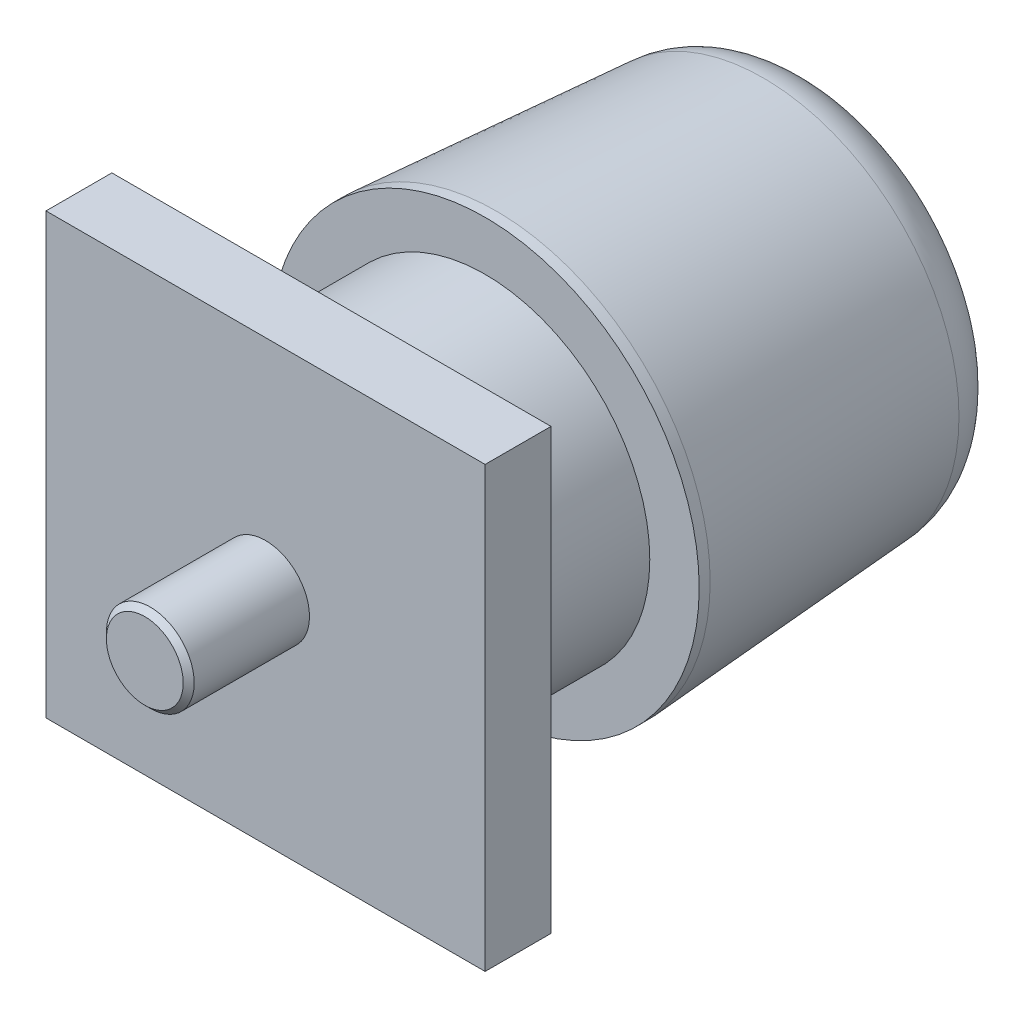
ISO-10303-21;
HEADER;
FILE_DESCRIPTION(('STEP AP214'),'2;1');
FILE_NAME('part.step','',(''),(''),'','','');
FILE_SCHEMA(('AUTOMOTIVE_DESIGN { 1 0 10303 214 1 1 1 1 }'));
ENDSEC;
DATA;
#1=APPLICATION_CONTEXT('core data for automotive mechanical design processes');
#2=APPLICATION_PROTOCOL_DEFINITION('international standard','automotive_design',2000,#1);
#3=PRODUCT_CONTEXT('',#1,'mechanical');
#4=PRODUCT('Part','Part','',(#3));
#5=PRODUCT_RELATED_PRODUCT_CATEGORY('part','',(#4));
#6=PRODUCT_DEFINITION_FORMATION('','',#4);
#7=PRODUCT_DEFINITION_CONTEXT('part definition',#1,'design');
#8=PRODUCT_DEFINITION('design','',#6,#7);
#9=PRODUCT_DEFINITION_SHAPE('','',#8);
#10=(LENGTH_UNIT() NAMED_UNIT(*) SI_UNIT(.MILLI.,.METRE.));
#11=(NAMED_UNIT(*) PLANE_ANGLE_UNIT() SI_UNIT($,.RADIAN.));
#12=(NAMED_UNIT(*) SI_UNIT($,.STERADIAN.) SOLID_ANGLE_UNIT());
#13=UNCERTAINTY_MEASURE_WITH_UNIT(LENGTH_MEASURE(1.E-05),#10,'distance_accuracy_value','');
#14=(GEOMETRIC_REPRESENTATION_CONTEXT(3) GLOBAL_UNCERTAINTY_ASSIGNED_CONTEXT((#13)) GLOBAL_UNIT_ASSIGNED_CONTEXT((#10,
#11,#12)) REPRESENTATION_CONTEXT('',''));
#15=CARTESIAN_POINT('',(0.,0.,0.));
#16=DIRECTION('',(0.,0.,1.));
#17=DIRECTION('',(1.,0.,0.));
#18=AXIS2_PLACEMENT_3D('',#15,#16,#17);
#19=CARTESIAN_POINT('',(-20.,-20.,50.));
#20=DIRECTION('',(0.,0.,1.));
#21=DIRECTION('',(1.,0.,0.));
#22=AXIS2_PLACEMENT_3D('',#19,#20,#21);
#23=PLANE('',#22);
#24=DIRECTION('',(0.,1.,0.));
#25=VECTOR('',#24,1.);
#26=CARTESIAN_POINT('',(-20.,0.,50.));
#27=LINE('',#26,#25);
#28=CARTESIAN_POINT('',(-20.,-20.,50.));
#29=VERTEX_POINT('',#28);
#30=CARTESIAN_POINT('',(-20.,20.,50.));
#31=VERTEX_POINT('',#30);
#32=EDGE_CURVE('E66',#29,#31,#27,.T.);
#33=ORIENTED_EDGE('',*,*,#32,.F.);
#34=DIRECTION('',(-1.,0.,0.));
#35=VECTOR('',#34,1.);
#36=CARTESIAN_POINT('',(0.,-20.,50.));
#37=LINE('',#36,#35);
#38=CARTESIAN_POINT('',(20.,-20.,50.));
#39=VERTEX_POINT('',#38);
#40=EDGE_CURVE('E86',#39,#29,#37,.T.);
#41=ORIENTED_EDGE('',*,*,#40,.F.);
#42=DIRECTION('',(0.,-1.,0.));
#43=VECTOR('',#42,1.);
#44=CARTESIAN_POINT('',(20.,0.,50.));
#45=LINE('',#44,#43);
#46=CARTESIAN_POINT('',(20.,20.,50.));
#47=VERTEX_POINT('',#46);
#48=EDGE_CURVE('E75',#47,#39,#45,.T.);
#49=ORIENTED_EDGE('',*,*,#48,.F.);
#50=DIRECTION('',(1.,0.,0.));
#51=VECTOR('',#50,1.);
#52=CARTESIAN_POINT('',(0.,20.,50.));
#53=LINE('',#52,#51);
#54=EDGE_CURVE('E98',#31,#47,#53,.T.);
#55=ORIENTED_EDGE('',*,*,#54,.F.);
#56=EDGE_LOOP('',(#33,#41,#49,#55));
#57=FACE_BOUND('',#56,.T.);
#58=CARTESIAN_POINT('',(0.,0.,50.));
#59=DIRECTION('',(0.,0.,1.));
#60=DIRECTION('',(1.,0.,0.));
#61=AXIS2_PLACEMENT_3D('',#58,#59,#60);
#62=CIRCLE('',#61,4.);
#63=CARTESIAN_POINT('',(4.,0.,50.));
#64=VERTEX_POINT('',#63);
#65=EDGE_CURVE('E84',#64,#64,#62,.T.);
#66=ORIENTED_EDGE('',*,*,#65,.F.);
#67=EDGE_LOOP('',(#66));
#68=FACE_BOUND('',#67,.T.);
#69=ADVANCED_FACE('F31',(#57,#68),#23,.T.);
#70=CARTESIAN_POINT('',(20.,-20.,50.));
#71=DIRECTION('',(1.,0.,0.));
#72=DIRECTION('',(0.,0.,-1.));
#73=AXIS2_PLACEMENT_3D('',#70,#71,#72);
#74=PLANE('',#73);
#75=DIRECTION('',(0.,0.,-1.));
#76=VECTOR('',#75,1.);
#77=CARTESIAN_POINT('',(20.,20.,47.));
#78=LINE('',#77,#76);
#79=CARTESIAN_POINT('',(20.,20.,44.));
#80=VERTEX_POINT('',#79);
#81=EDGE_CURVE('E81',#47,#80,#78,.T.);
#82=ORIENTED_EDGE('',*,*,#81,.F.);
#83=ORIENTED_EDGE('',*,*,#48,.T.);
#84=DIRECTION('',(0.,0.,1.));
#85=VECTOR('',#84,1.);
#86=CARTESIAN_POINT('',(20.,-20.,47.));
#87=LINE('',#86,#85);
#88=CARTESIAN_POINT('',(20.,-20.,44.));
#89=VERTEX_POINT('',#88);
#90=EDGE_CURVE('E79',#89,#39,#87,.T.);
#91=ORIENTED_EDGE('',*,*,#90,.F.);
#92=DIRECTION('',(0.,-1.,0.));
#93=VECTOR('',#92,1.);
#94=CARTESIAN_POINT('',(20.,0.,44.));
#95=LINE('',#94,#93);
#96=EDGE_CURVE('E62',#80,#89,#95,.T.);
#97=ORIENTED_EDGE('',*,*,#96,.F.);
#98=EDGE_LOOP('',(#82,#83,#91,#97));
#99=FACE_BOUND('',#98,.T.);
#100=ADVANCED_FACE('F77',(#99),#74,.T.);
#101=CARTESIAN_POINT('',(-20.,-20.,50.));
#102=DIRECTION('',(0.,-1.,0.));
#103=DIRECTION('',(0.,0.,-1.));
#104=AXIS2_PLACEMENT_3D('',#101,#102,#103);
#105=PLANE('',#104);
#106=ORIENTED_EDGE('',*,*,#90,.T.);
#107=ORIENTED_EDGE('',*,*,#40,.T.);
#108=DIRECTION('',(0.,0.,1.));
#109=VECTOR('',#108,1.);
#110=CARTESIAN_POINT('',(-20.,-20.,47.));
#111=LINE('',#110,#109);
#112=CARTESIAN_POINT('',(-20.,-20.,44.));
#113=VERTEX_POINT('',#112);
#114=EDGE_CURVE('E89',#113,#29,#111,.T.);
#115=ORIENTED_EDGE('',*,*,#114,.F.);
#116=DIRECTION('',(-1.,0.,0.));
#117=VECTOR('',#116,1.);
#118=CARTESIAN_POINT('',(0.,-20.,44.));
#119=LINE('',#118,#117);
#120=EDGE_CURVE('E93',#89,#113,#119,.T.);
#121=ORIENTED_EDGE('',*,*,#120,.F.);
#122=EDGE_LOOP('',(#106,#107,#115,#121));
#123=FACE_BOUND('',#122,.T.);
#124=ADVANCED_FACE('F91',(#123),#105,.T.);
#125=CARTESIAN_POINT('',(-20.,-20.,44.));
#126=DIRECTION('',(-1.,0.,0.));
#127=DIRECTION('',(0.,0.,1.));
#128=AXIS2_PLACEMENT_3D('',#125,#126,#127);
#129=PLANE('',#128);
#130=ORIENTED_EDGE('',*,*,#114,.T.);
#131=ORIENTED_EDGE('',*,*,#32,.T.);
#132=DIRECTION('',(0.,0.,1.));
#133=VECTOR('',#132,1.);
#134=CARTESIAN_POINT('',(-20.,20.,47.));
#135=LINE('',#134,#133);
#136=CARTESIAN_POINT('',(-20.,20.,44.));
#137=VERTEX_POINT('',#136);
#138=EDGE_CURVE('E48',#137,#31,#135,.T.);
#139=ORIENTED_EDGE('',*,*,#138,.F.);
#140=DIRECTION('',(0.,1.,0.));
#141=VECTOR('',#140,1.);
#142=CARTESIAN_POINT('',(-20.,0.,44.));
#143=LINE('',#142,#141);
#144=EDGE_CURVE('E106',#113,#137,#143,.T.);
#145=ORIENTED_EDGE('',*,*,#144,.F.);
#146=EDGE_LOOP('',(#130,#131,#139,#145));
#147=FACE_BOUND('',#146,.T.);
#148=ADVANCED_FACE('F192',(#147),#129,.T.);
#149=CARTESIAN_POINT('',(-20.,20.,44.));
#150=DIRECTION('',(0.,1.,0.));
#151=DIRECTION('',(0.,0.,1.));
#152=AXIS2_PLACEMENT_3D('',#149,#150,#151);
#153=PLANE('',#152);
#154=ORIENTED_EDGE('',*,*,#138,.T.);
#155=ORIENTED_EDGE('',*,*,#54,.T.);
#156=ORIENTED_EDGE('',*,*,#81,.T.);
#157=DIRECTION('',(1.,0.,0.));
#158=VECTOR('',#157,1.);
#159=CARTESIAN_POINT('',(0.,20.,44.));
#160=LINE('',#159,#158);
#161=EDGE_CURVE('E102',#137,#80,#160,.T.);
#162=ORIENTED_EDGE('',*,*,#161,.F.);
#163=EDGE_LOOP('',(#154,#155,#156,#162));
#164=FACE_BOUND('',#163,.T.);
#165=ADVANCED_FACE('F188',(#164),#153,.T.);
#166=CARTESIAN_POINT('',(20.,-20.,44.));
#167=DIRECTION('',(0.,0.,-1.));
#168=DIRECTION('',(-1.,0.,0.));
#169=AXIS2_PLACEMENT_3D('',#166,#167,#168);
#170=PLANE('',#169);
#171=CARTESIAN_POINT('',(0.,0.,44.));
#172=DIRECTION('',(0.,0.,1.));
#173=DIRECTION('',(1.,0.,0.));
#174=AXIS2_PLACEMENT_3D('',#171,#172,#173);
#175=CIRCLE('',#174,15.);
#176=CARTESIAN_POINT('',(15.,0.,44.));
#177=VERTEX_POINT('',#176);
#178=EDGE_CURVE('E105',#177,#177,#175,.F.);
#179=ORIENTED_EDGE('',*,*,#178,.F.);
#180=EDGE_LOOP('',(#179));
#181=FACE_BOUND('',#180,.T.);
#182=ORIENTED_EDGE('',*,*,#144,.T.);
#183=ORIENTED_EDGE('',*,*,#161,.T.);
#184=ORIENTED_EDGE('',*,*,#96,.T.);
#185=ORIENTED_EDGE('',*,*,#120,.T.);
#186=EDGE_LOOP('',(#182,#183,#184,#185));
#187=FACE_BOUND('',#186,.T.);
#188=ADVANCED_FACE('F182',(#181,#187),#170,.T.);
#189=CARTESIAN_POINT('',(0.,0.,30.));
#190=DIRECTION('',(0.,0.,1.));
#191=DIRECTION('',(1.,0.,0.));
#192=AXIS2_PLACEMENT_3D('',#189,#190,#191);
#193=CYLINDRICAL_SURFACE('',#192,15.);
#194=CARTESIAN_POINT('',(0.,0.,30.));
#195=DIRECTION('',(0.,0.,1.));
#196=DIRECTION('',(1.,0.,0.));
#197=AXIS2_PLACEMENT_3D('',#194,#195,#196);
#198=CIRCLE('',#197,15.);
#199=CARTESIAN_POINT('',(15.,0.,30.));
#200=VERTEX_POINT('',#199);
#201=EDGE_CURVE('E123',#200,#200,#198,.F.);
#202=ORIENTED_EDGE('',*,*,#201,.F.);
#203=EDGE_LOOP('',(#202));
#204=FACE_BOUND('',#203,.T.);
#205=ORIENTED_EDGE('',*,*,#178,.T.);
#206=EDGE_LOOP('',(#205));
#207=FACE_BOUND('',#206,.T.);
#208=ADVANCED_FACE('F176',(#204,#207),#193,.T.);
#209=CARTESIAN_POINT('',(19.5,19.5,30.));
#210=DIRECTION('',(0.,0.,1.));
#211=DIRECTION('',(-1.,0.,0.));
#212=AXIS2_PLACEMENT_3D('',#209,#210,#211);
#213=PLANE('',#212);
#214=ORIENTED_EDGE('',*,*,#201,.T.);
#215=EDGE_LOOP('',(#214));
#216=FACE_BOUND('',#215,.T.);
#217=CARTESIAN_POINT('',(0.,0.,30.));
#218=DIRECTION('',(0.,0.,1.));
#219=DIRECTION('',(1.,0.,0.));
#220=AXIS2_PLACEMENT_3D('',#217,#218,#219);
#221=CIRCLE('',#220,19.5);
#222=CARTESIAN_POINT('',(19.5,0.,30.));
#223=VERTEX_POINT('',#222);
#224=EDGE_CURVE('E120',#223,#223,#221,.F.);
#225=ORIENTED_EDGE('',*,*,#224,.F.);
#226=EDGE_LOOP('',(#225));
#227=FACE_BOUND('',#226,.T.);
#228=ADVANCED_FACE('F171',(#216,#227),#213,.T.);
#229=CARTESIAN_POINT('',(0.,0.,29.));
#230=DIRECTION('',(0.,0.,1.));
#231=DIRECTION('',(1.,0.,0.));
#232=AXIS2_PLACEMENT_3D('',#229,#230,#231);
#233=CYLINDRICAL_SURFACE('',#232,19.5);
#234=CARTESIAN_POINT('',(0.,0.,29.));
#235=DIRECTION('',(0.,0.,1.));
#236=DIRECTION('',(1.,0.,0.));
#237=AXIS2_PLACEMENT_3D('',#234,#235,#236);
#238=CIRCLE('',#237,19.5);
#239=CARTESIAN_POINT('',(19.5,0.,29.));
#240=VERTEX_POINT('',#239);
#241=EDGE_CURVE('E117',#240,#240,#238,.F.);
#242=ORIENTED_EDGE('',*,*,#241,.F.);
#243=EDGE_LOOP('',(#242));
#244=FACE_BOUND('',#243,.T.);
#245=ORIENTED_EDGE('',*,*,#224,.T.);
#246=EDGE_LOOP('',(#245));
#247=FACE_BOUND('',#246,.T.);
#248=ADVANCED_FACE('F165',(#244,#247),#233,.T.);
#249=CARTESIAN_POINT('',(0.,0.,4.65598954));
#250=DIRECTION('',(0.,0.,1.));
#251=DIRECTION('',(1.,0.,0.));
#252=AXIS2_PLACEMENT_3D('',#249,#250,#251);
#253=CONICAL_SURFACE('',#252,17.82110273,0.068856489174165);
#254=CARTESIAN_POINT('',(0.,0.,4.65598954));
#255=DIRECTION('',(0.,0.,1.));
#256=DIRECTION('',(1.,0.,0.));
#257=AXIS2_PLACEMENT_3D('',#254,#255,#256);
#258=CIRCLE('',#257,17.82110273);
#259=CARTESIAN_POINT('',(17.82110273,0.,4.65598954));
#260=VERTEX_POINT('',#259);
#261=EDGE_CURVE('E114',#260,#260,#258,.F.);
#262=ORIENTED_EDGE('',*,*,#261,.F.);
#263=EDGE_LOOP('',(#262));
#264=FACE_BOUND('',#263,.T.);
#265=ORIENTED_EDGE('',*,*,#241,.T.);
#266=EDGE_LOOP('',(#265));
#267=FACE_BOUND('',#266,.T.);
#268=ADVANCED_FACE('F157',(#264,#267),#253,.T.);
#269=CARTESIAN_POINT('',(-12.83295109,12.83295109,9.8879E-10));
#270=DIRECTION('',(0.,0.,-1.));
#271=DIRECTION('',(1.,0.,0.));
#272=AXIS2_PLACEMENT_3D('',#269,#270,#271);
#273=PLANE('',#272);
#274=CARTESIAN_POINT('',(0.,0.,1.97758996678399E-09));
#275=DIRECTION('',(0.,0.,1.));
#276=DIRECTION('',(1.,0.,0.));
#277=AXIS2_PLACEMENT_3D('',#274,#275,#276);
#278=CIRCLE('',#277,12.83295109);
#279=CARTESIAN_POINT('',(12.83295109,0.,1.97758996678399E-09));
#280=VERTEX_POINT('',#279);
#281=EDGE_CURVE('E111',#280,#280,#278,.T.);
#282=ORIENTED_EDGE('',*,*,#281,.F.);
#283=EDGE_LOOP('',(#282));
#284=FACE_BOUND('',#283,.T.);
#285=ADVANCED_FACE('F150',(#284),#273,.T.);
#286=CARTESIAN_POINT('',(0.,0.,5.));
#287=DIRECTION('',(0.,0.,1.));
#288=DIRECTION('',(1.,0.,0.));
#289=AXIS2_PLACEMENT_3D('',#286,#287,#288);
#290=TOROIDAL_SURFACE('',#289,12.83295109,4.99999999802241);
#291=ORIENTED_EDGE('',*,*,#261,.T.);
#292=EDGE_LOOP('',(#291));
#293=FACE_BOUND('',#292,.T.);
#294=ORIENTED_EDGE('',*,*,#281,.T.);
#295=EDGE_LOOP('',(#294));
#296=FACE_BOUND('',#295,.T.);
#297=ADVANCED_FACE('F33',(#293,#296),#290,.T.);
#298=CARTESIAN_POINT('',(0.,0.,61.));
#299=DIRECTION('',(0.,0.,-1.));
#300=DIRECTION('',(-1.,0.,0.));
#301=AXIS2_PLACEMENT_3D('',#298,#299,#300);
#302=CYLINDRICAL_SURFACE('',#301,4.);
#303=CARTESIAN_POINT('',(0.,0.,60.5));
#304=DIRECTION('',(0.,0.,1.));
#305=DIRECTION('',(1.,0.,0.));
#306=AXIS2_PLACEMENT_3D('',#303,#304,#305);
#307=CIRCLE('',#306,4.);
#308=CARTESIAN_POINT('',(4.,0.,60.5));
#309=VERTEX_POINT('',#308);
#310=EDGE_CURVE('E11',#309,#309,#307,.F.);
#311=ORIENTED_EDGE('',*,*,#310,.T.);
#312=EDGE_LOOP('',(#311));
#313=FACE_BOUND('',#312,.T.);
#314=ORIENTED_EDGE('',*,*,#65,.T.);
#315=EDGE_LOOP('',(#314));
#316=FACE_BOUND('',#315,.T.);
#317=ADVANCED_FACE('F139',(#313,#316),#302,.T.);
#318=CARTESIAN_POINT('',(0.,0.,61.));
#319=DIRECTION('',(0.,0.,1.));
#320=DIRECTION('',(1.,0.,0.));
#321=AXIS2_PLACEMENT_3D('',#318,#319,#320);
#322=PLANE('',#321);
#323=CARTESIAN_POINT('',(0.,0.,61.));
#324=DIRECTION('',(0.,0.,1.));
#325=DIRECTION('',(1.,0.,0.));
#326=AXIS2_PLACEMENT_3D('',#323,#324,#325);
#327=CIRCLE('',#326,3.5);
#328=CARTESIAN_POINT('',(3.5,0.,61.));
#329=VERTEX_POINT('',#328);
#330=EDGE_CURVE('E40',#329,#329,#327,.T.);
#331=ORIENTED_EDGE('',*,*,#330,.T.);
#332=EDGE_LOOP('',(#331));
#333=FACE_BOUND('',#332,.T.);
#334=ADVANCED_FACE('F130',(#333),#322,.T.);
#335=CARTESIAN_POINT('',(0.,0.,61.));
#336=DIRECTION('',(0.,0.,-1.));
#337=DIRECTION('',(-1.,0.,0.));
#338=AXIS2_PLACEMENT_3D('',#335,#336,#337);
#339=CONICAL_SURFACE('',#338,3.5,0.785398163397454);
#340=ORIENTED_EDGE('',*,*,#310,.F.);
#341=EDGE_LOOP('',(#340));
#342=FACE_BOUND('',#341,.T.);
#343=ORIENTED_EDGE('',*,*,#330,.F.);
#344=EDGE_LOOP('',(#343));
#345=FACE_BOUND('',#344,.T.);
#346=ADVANCED_FACE('F132',(#342,#345),#339,.T.);
#347=CLOSED_SHELL('',(#69,#100,#124,#148,#165,#188,#208,#228,#248,#268,#285,#297,#317,#334,#346));
#348=MANIFOLD_SOLID_BREP('B2',#347);
#349=ADVANCED_BREP_SHAPE_REPRESENTATION('',(#18,#348),#14);
#350=SHAPE_DEFINITION_REPRESENTATION(#9,#349);
ENDSEC;
END-ISO-10303-21;
